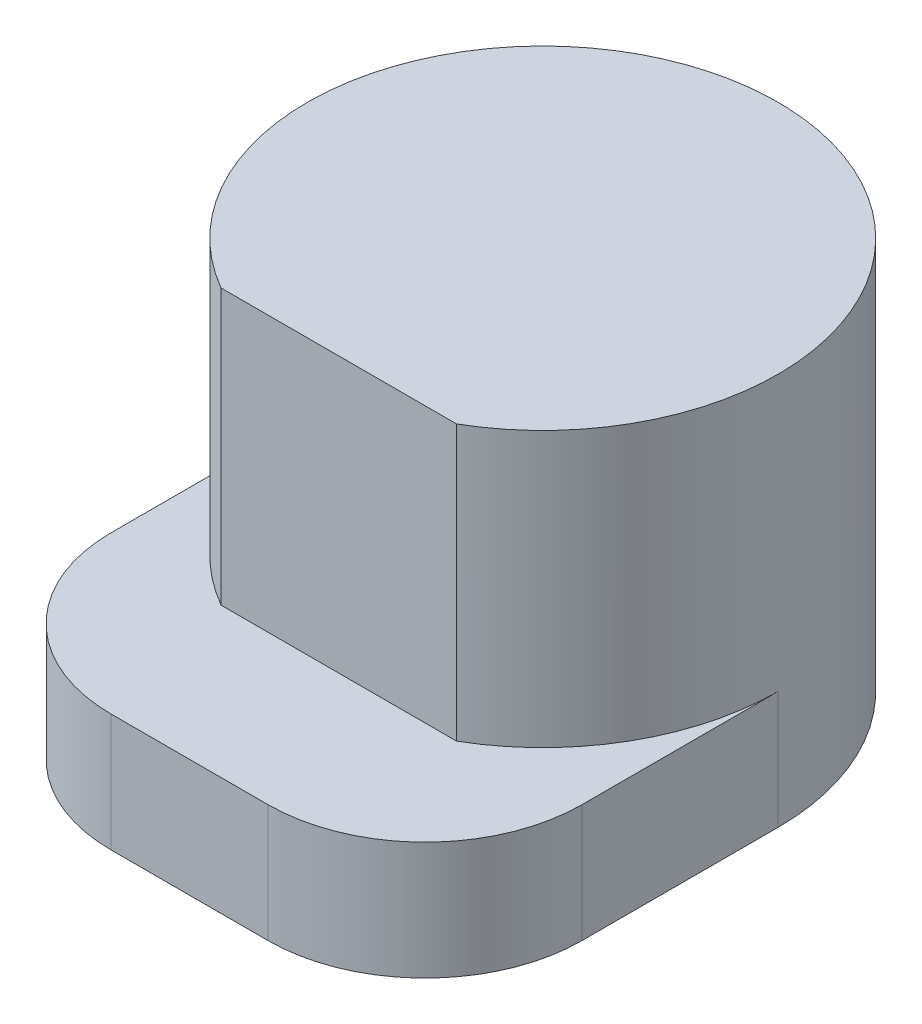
ISO-10303-21;
HEADER;
FILE_DESCRIPTION(('STEP AP214'),'2;1');
FILE_NAME('part.step','',(''),(''),'','','');
FILE_SCHEMA(('AUTOMOTIVE_DESIGN { 1 0 10303 214 1 1 1 1 }'));
ENDSEC;
DATA;
#1=APPLICATION_CONTEXT('core data for automotive mechanical design processes');
#2=APPLICATION_PROTOCOL_DEFINITION('international standard','automotive_design',2000,#1);
#3=PRODUCT_CONTEXT('',#1,'mechanical');
#4=PRODUCT('Part','Part','',(#3));
#5=PRODUCT_RELATED_PRODUCT_CATEGORY('part','',(#4));
#6=PRODUCT_DEFINITION_FORMATION('','',#4);
#7=PRODUCT_DEFINITION_CONTEXT('part definition',#1,'design');
#8=PRODUCT_DEFINITION('design','',#6,#7);
#9=PRODUCT_DEFINITION_SHAPE('','',#8);
#10=(LENGTH_UNIT() NAMED_UNIT(*) SI_UNIT(.MILLI.,.METRE.));
#11=(NAMED_UNIT(*) PLANE_ANGLE_UNIT() SI_UNIT($,.RADIAN.));
#12=(NAMED_UNIT(*) SI_UNIT($,.STERADIAN.) SOLID_ANGLE_UNIT());
#13=UNCERTAINTY_MEASURE_WITH_UNIT(LENGTH_MEASURE(1.E-05),#10,'distance_accuracy_value','');
#14=(GEOMETRIC_REPRESENTATION_CONTEXT(3) GLOBAL_UNCERTAINTY_ASSIGNED_CONTEXT((#13)) GLOBAL_UNIT_ASSIGNED_CONTEXT((#10,
#11,#12)) REPRESENTATION_CONTEXT('',''));
#15=CARTESIAN_POINT('',(0.,0.,0.));
#16=DIRECTION('',(0.,0.,1.));
#17=DIRECTION('',(1.,0.,0.));
#18=AXIS2_PLACEMENT_3D('',#15,#16,#17);
#19=CARTESIAN_POINT('',(0.,100.,0.));
#20=DIRECTION('',(0.,-1.,0.));
#21=DIRECTION('',(0.,0.,-1.));
#22=AXIS2_PLACEMENT_3D('',#19,#20,#21);
#23=CYLINDRICAL_SURFACE('',#22,60.);
#24=CARTESIAN_POINT('',(0.,30.,0.));
#25=DIRECTION('',(0.,1.,0.));
#26=DIRECTION('',(0.,0.,1.));
#27=AXIS2_PLACEMENT_3D('',#24,#25,#26);
#28=CIRCLE('',#27,60.);
#29=CARTESIAN_POINT('',(30.,30.,51.9615242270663));
#30=VERTEX_POINT('',#29);
#31=CARTESIAN_POINT('',(60.,30.,0.));
#32=VERTEX_POINT('',#31);
#33=EDGE_CURVE('E46',#30,#32,#28,.T.);
#34=ORIENTED_EDGE('',*,*,#33,.T.);
#35=DIRECTION('',(0.,-1.,0.));
#36=VECTOR('',#35,1.);
#37=CARTESIAN_POINT('',(60.,30.,0.));
#38=LINE('',#37,#36);
#39=CARTESIAN_POINT('',(60.,0.,0.));
#40=VERTEX_POINT('',#39);
#41=EDGE_CURVE('E125',#32,#40,#38,.T.);
#42=ORIENTED_EDGE('',*,*,#41,.T.);
#43=CARTESIAN_POINT('',(0.,0.,0.));
#44=DIRECTION('',(0.,1.,0.));
#45=DIRECTION('',(0.,0.,1.));
#46=AXIS2_PLACEMENT_3D('',#43,#44,#45);
#47=CIRCLE('',#46,60.);
#48=CARTESIAN_POINT('',(-60.,0.,0.));
#49=VERTEX_POINT('',#48);
#50=EDGE_CURVE('E121',#40,#49,#47,.T.);
#51=ORIENTED_EDGE('',*,*,#50,.T.);
#52=DIRECTION('',(0.,-1.,0.));
#53=VECTOR('',#52,1.);
#54=CARTESIAN_POINT('',(-60.,30.,0.));
#55=LINE('',#54,#53);
#56=CARTESIAN_POINT('',(-60.,30.,0.));
#57=VERTEX_POINT('',#56);
#58=EDGE_CURVE('E53',#57,#49,#55,.T.);
#59=ORIENTED_EDGE('',*,*,#58,.F.);
#60=CARTESIAN_POINT('',(0.,30.,0.));
#61=DIRECTION('',(0.,1.,0.));
#62=DIRECTION('',(0.,0.,1.));
#63=AXIS2_PLACEMENT_3D('',#60,#61,#62);
#64=CIRCLE('',#63,60.);
#65=CARTESIAN_POINT('',(-30.,30.,51.9615242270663));
#66=VERTEX_POINT('',#65);
#67=EDGE_CURVE('E171',#57,#66,#64,.T.);
#68=ORIENTED_EDGE('',*,*,#67,.T.);
#69=DIRECTION('',(0.,-1.,0.));
#70=VECTOR('',#69,1.);
#71=CARTESIAN_POINT('',(-30.,100.,51.9615242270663));
#72=LINE('',#71,#70);
#73=CARTESIAN_POINT('',(-30.,100.,51.9615242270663));
#74=VERTEX_POINT('',#73);
#75=EDGE_CURVE('E39',#74,#66,#72,.T.);
#76=ORIENTED_EDGE('',*,*,#75,.F.);
#77=CARTESIAN_POINT('',(0.,100.,0.));
#78=DIRECTION('',(0.,1.,0.));
#79=DIRECTION('',(0.,0.,1.));
#80=AXIS2_PLACEMENT_3D('',#77,#78,#79);
#81=CIRCLE('',#80,60.);
#82=CARTESIAN_POINT('',(30.,100.,51.9615242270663));
#83=VERTEX_POINT('',#82);
#84=EDGE_CURVE('E131',#83,#74,#81,.T.);
#85=ORIENTED_EDGE('',*,*,#84,.F.);
#86=DIRECTION('',(0.,-1.,0.));
#87=VECTOR('',#86,1.);
#88=CARTESIAN_POINT('',(30.,100.,51.9615242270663));
#89=LINE('',#88,#87);
#90=EDGE_CURVE('E11',#83,#30,#89,.T.);
#91=ORIENTED_EDGE('',*,*,#90,.T.);
#92=EDGE_LOOP('',(#34,#42,#51,#59,#68,#76,#85,#91));
#93=FACE_BOUND('',#92,.T.);
#94=ADVANCED_FACE('F30',(#93),#23,.T.);
#95=CARTESIAN_POINT('',(-149.555276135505,100.,51.9615242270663));
#96=DIRECTION('',(0.,0.,-1.));
#97=DIRECTION('',(-1.,0.,0.));
#98=AXIS2_PLACEMENT_3D('',#95,#96,#97);
#99=PLANE('',#98);
#100=ORIENTED_EDGE('',*,*,#75,.T.);
#101=DIRECTION('',(1.,0.,0.));
#102=VECTOR('',#101,1.);
#103=CARTESIAN_POINT('',(-149.555276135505,30.,51.9615242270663));
#104=LINE('',#103,#102);
#105=EDGE_CURVE('E174',#66,#30,#104,.T.);
#106=ORIENTED_EDGE('',*,*,#105,.T.);
#107=ORIENTED_EDGE('',*,*,#90,.F.);
#108=DIRECTION('',(1.,0.,0.));
#109=VECTOR('',#108,1.);
#110=CARTESIAN_POINT('',(-149.555276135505,100.,51.9615242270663));
#111=LINE('',#110,#109);
#112=EDGE_CURVE('E123',#74,#83,#111,.T.);
#113=ORIENTED_EDGE('',*,*,#112,.F.);
#114=EDGE_LOOP('',(#100,#106,#107,#113));
#115=FACE_BOUND('',#114,.T.);
#116=ADVANCED_FACE('F32',(#115),#99,.F.);
#117=CARTESIAN_POINT('',(-149.555276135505,100.,15.));
#118=DIRECTION('',(0.,1.,0.));
#119=DIRECTION('',(0.,0.,1.));
#120=AXIS2_PLACEMENT_3D('',#117,#118,#119);
#121=PLANE('',#120);
#122=ORIENTED_EDGE('',*,*,#112,.T.);
#123=ORIENTED_EDGE('',*,*,#84,.T.);
#124=EDGE_LOOP('',(#122,#123));
#125=FACE_BOUND('',#124,.T.);
#126=ADVANCED_FACE('F194',(#125),#121,.T.);
#127=CARTESIAN_POINT('',(-149.555276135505,0.,15.));
#128=DIRECTION('',(0.,1.,0.));
#129=DIRECTION('',(0.,0.,1.));
#130=AXIS2_PLACEMENT_3D('',#127,#128,#129);
#131=PLANE('',#130);
#132=ORIENTED_EDGE('',*,*,#50,.F.);
#133=DIRECTION('',(0.,0.,-1.));
#134=VECTOR('',#133,1.);
#135=CARTESIAN_POINT('',(60.,0.,14.9999999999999));
#136=LINE('',#135,#134);
#137=CARTESIAN_POINT('',(60.,0.,50.));
#138=VERTEX_POINT('',#137);
#139=EDGE_CURVE('E142',#138,#40,#136,.T.);
#140=ORIENTED_EDGE('',*,*,#139,.F.);
#141=CARTESIAN_POINT('',(20.,0.,50.));
#142=DIRECTION('',(0.,1.,0.));
#143=DIRECTION('',(0.,0.,1.));
#144=AXIS2_PLACEMENT_3D('',#141,#142,#143);
#145=CIRCLE('',#144,40.);
#146=CARTESIAN_POINT('',(20.,0.,90.));
#147=VERTEX_POINT('',#146);
#148=EDGE_CURVE('E148',#147,#138,#145,.T.);
#149=ORIENTED_EDGE('',*,*,#148,.F.);
#150=DIRECTION('',(1.,0.,0.));
#151=VECTOR('',#150,1.);
#152=CARTESIAN_POINT('',(-149.555276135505,0.,90.));
#153=LINE('',#152,#151);
#154=CARTESIAN_POINT('',(-20.,0.,90.));
#155=VERTEX_POINT('',#154);
#156=EDGE_CURVE('E120',#155,#147,#153,.T.);
#157=ORIENTED_EDGE('',*,*,#156,.F.);
#158=CARTESIAN_POINT('',(-20.,0.,50.));
#159=DIRECTION('',(0.,1.,0.));
#160=DIRECTION('',(0.,0.,1.));
#161=AXIS2_PLACEMENT_3D('',#158,#159,#160);
#162=CIRCLE('',#161,40.);
#163=CARTESIAN_POINT('',(-60.,0.,50.));
#164=VERTEX_POINT('',#163);
#165=EDGE_CURVE('E116',#164,#155,#162,.T.);
#166=ORIENTED_EDGE('',*,*,#165,.F.);
#167=DIRECTION('',(0.,0.,1.));
#168=VECTOR('',#167,1.);
#169=CARTESIAN_POINT('',(-60.,0.,15.));
#170=LINE('',#169,#168);
#171=EDGE_CURVE('E140',#49,#164,#170,.T.);
#172=ORIENTED_EDGE('',*,*,#171,.F.);
#173=EDGE_LOOP('',(#132,#140,#149,#157,#166,#172));
#174=FACE_BOUND('',#173,.T.);
#175=ADVANCED_FACE('F167',(#174),#131,.F.);
#176=CARTESIAN_POINT('',(-149.555276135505,30.,90.));
#177=DIRECTION('',(0.,0.,-1.));
#178=DIRECTION('',(-1.,0.,0.));
#179=AXIS2_PLACEMENT_3D('',#176,#177,#178);
#180=PLANE('',#179);
#181=ORIENTED_EDGE('',*,*,#156,.T.);
#182=DIRECTION('',(0.,-1.,0.));
#183=VECTOR('',#182,1.);
#184=CARTESIAN_POINT('',(20.,30.,90.));
#185=LINE('',#184,#183);
#186=CARTESIAN_POINT('',(20.,30.,90.));
#187=VERTEX_POINT('',#186);
#188=EDGE_CURVE('E100',#187,#147,#185,.T.);
#189=ORIENTED_EDGE('',*,*,#188,.F.);
#190=DIRECTION('',(1.,0.,0.));
#191=VECTOR('',#190,1.);
#192=CARTESIAN_POINT('',(-149.555276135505,30.,90.));
#193=LINE('',#192,#191);
#194=CARTESIAN_POINT('',(-20.,30.,90.));
#195=VERTEX_POINT('',#194);
#196=EDGE_CURVE('E107',#195,#187,#193,.T.);
#197=ORIENTED_EDGE('',*,*,#196,.F.);
#198=DIRECTION('',(0.,-1.,0.));
#199=VECTOR('',#198,1.);
#200=CARTESIAN_POINT('',(-20.,30.,90.));
#201=LINE('',#200,#199);
#202=EDGE_CURVE('E157',#195,#155,#201,.T.);
#203=ORIENTED_EDGE('',*,*,#202,.T.);
#204=EDGE_LOOP('',(#181,#189,#197,#203));
#205=FACE_BOUND('',#204,.T.);
#206=ADVANCED_FACE('F118',(#205),#180,.F.);
#207=CARTESIAN_POINT('',(20.,30.,50.));
#208=DIRECTION('',(0.,-1.,0.));
#209=DIRECTION('',(0.,0.,-1.));
#210=AXIS2_PLACEMENT_3D('',#207,#208,#209);
#211=CYLINDRICAL_SURFACE('',#210,40.);
#212=ORIENTED_EDGE('',*,*,#148,.T.);
#213=DIRECTION('',(0.,-1.,0.));
#214=VECTOR('',#213,1.);
#215=CARTESIAN_POINT('',(60.,30.,50.));
#216=LINE('',#215,#214);
#217=CARTESIAN_POINT('',(60.,30.,50.));
#218=VERTEX_POINT('',#217);
#219=EDGE_CURVE('E103',#218,#138,#216,.T.);
#220=ORIENTED_EDGE('',*,*,#219,.F.);
#221=CARTESIAN_POINT('',(20.,30.,50.));
#222=DIRECTION('',(0.,1.,0.));
#223=DIRECTION('',(0.,0.,1.));
#224=AXIS2_PLACEMENT_3D('',#221,#222,#223);
#225=CIRCLE('',#224,40.);
#226=EDGE_CURVE('E96',#187,#218,#225,.T.);
#227=ORIENTED_EDGE('',*,*,#226,.F.);
#228=ORIENTED_EDGE('',*,*,#188,.T.);
#229=EDGE_LOOP('',(#212,#220,#227,#228));
#230=FACE_BOUND('',#229,.T.);
#231=ADVANCED_FACE('F98',(#230),#211,.T.);
#232=CARTESIAN_POINT('',(60.,30.,14.9999999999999));
#233=DIRECTION('',(-1.,0.,0.));
#234=DIRECTION('',(0.,0.,1.));
#235=AXIS2_PLACEMENT_3D('',#232,#233,#234);
#236=PLANE('',#235);
#237=ORIENTED_EDGE('',*,*,#139,.T.);
#238=ORIENTED_EDGE('',*,*,#41,.F.);
#239=DIRECTION('',(0.,0.,-1.));
#240=VECTOR('',#239,1.);
#241=CARTESIAN_POINT('',(60.,30.,14.9999999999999));
#242=LINE('',#241,#240);
#243=EDGE_CURVE('E106',#218,#32,#242,.T.);
#244=ORIENTED_EDGE('',*,*,#243,.F.);
#245=ORIENTED_EDGE('',*,*,#219,.T.);
#246=EDGE_LOOP('',(#237,#238,#244,#245));
#247=FACE_BOUND('',#246,.T.);
#248=ADVANCED_FACE('F181',(#247),#236,.F.);
#249=CARTESIAN_POINT('',(-60.,30.,15.));
#250=DIRECTION('',(1.,0.,0.));
#251=DIRECTION('',(0.,0.,-1.));
#252=AXIS2_PLACEMENT_3D('',#249,#250,#251);
#253=PLANE('',#252);
#254=ORIENTED_EDGE('',*,*,#171,.T.);
#255=DIRECTION('',(0.,-1.,0.));
#256=VECTOR('',#255,1.);
#257=CARTESIAN_POINT('',(-60.,30.,50.));
#258=LINE('',#257,#256);
#259=CARTESIAN_POINT('',(-60.,30.,50.));
#260=VERTEX_POINT('',#259);
#261=EDGE_CURVE('E137',#260,#164,#258,.T.);
#262=ORIENTED_EDGE('',*,*,#261,.F.);
#263=DIRECTION('',(0.,0.,1.));
#264=VECTOR('',#263,1.);
#265=CARTESIAN_POINT('',(-60.,30.,15.));
#266=LINE('',#265,#264);
#267=EDGE_CURVE('E169',#57,#260,#266,.T.);
#268=ORIENTED_EDGE('',*,*,#267,.F.);
#269=ORIENTED_EDGE('',*,*,#58,.T.);
#270=EDGE_LOOP('',(#254,#262,#268,#269));
#271=FACE_BOUND('',#270,.T.);
#272=ADVANCED_FACE('F168',(#271),#253,.F.);
#273=CARTESIAN_POINT('',(-20.,30.,50.));
#274=DIRECTION('',(0.,-1.,0.));
#275=DIRECTION('',(0.,0.,-1.));
#276=AXIS2_PLACEMENT_3D('',#273,#274,#275);
#277=CYLINDRICAL_SURFACE('',#276,40.);
#278=ORIENTED_EDGE('',*,*,#165,.T.);
#279=ORIENTED_EDGE('',*,*,#202,.F.);
#280=CARTESIAN_POINT('',(-20.,30.,50.));
#281=DIRECTION('',(0.,1.,0.));
#282=DIRECTION('',(0.,0.,1.));
#283=AXIS2_PLACEMENT_3D('',#280,#281,#282);
#284=CIRCLE('',#283,40.);
#285=EDGE_CURVE('E112',#260,#195,#284,.T.);
#286=ORIENTED_EDGE('',*,*,#285,.F.);
#287=ORIENTED_EDGE('',*,*,#261,.T.);
#288=EDGE_LOOP('',(#278,#279,#286,#287));
#289=FACE_BOUND('',#288,.T.);
#290=ADVANCED_FACE('F162',(#289),#277,.T.);
#291=CARTESIAN_POINT('',(-149.555276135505,30.,15.));
#292=DIRECTION('',(0.,1.,0.));
#293=DIRECTION('',(0.,0.,1.));
#294=AXIS2_PLACEMENT_3D('',#291,#292,#293);
#295=PLANE('',#294);
#296=ORIENTED_EDGE('',*,*,#196,.T.);
#297=ORIENTED_EDGE('',*,*,#226,.T.);
#298=ORIENTED_EDGE('',*,*,#243,.T.);
#299=ORIENTED_EDGE('',*,*,#33,.F.);
#300=ORIENTED_EDGE('',*,*,#105,.F.);
#301=ORIENTED_EDGE('',*,*,#67,.F.);
#302=ORIENTED_EDGE('',*,*,#267,.T.);
#303=ORIENTED_EDGE('',*,*,#285,.T.);
#304=EDGE_LOOP('',(#296,#297,#298,#299,#300,#301,#302,#303));
#305=FACE_BOUND('',#304,.T.);
#306=ADVANCED_FACE('F110',(#305),#295,.T.);
#307=CLOSED_SHELL('',(#94,#116,#126,#175,#206,#231,#248,#272,#290,#306));
#308=MANIFOLD_SOLID_BREP('B2',#307);
#309=ADVANCED_BREP_SHAPE_REPRESENTATION('',(#18,#308),#14);
#310=SHAPE_DEFINITION_REPRESENTATION(#9,#309);
ENDSEC;
END-ISO-10303-21;
